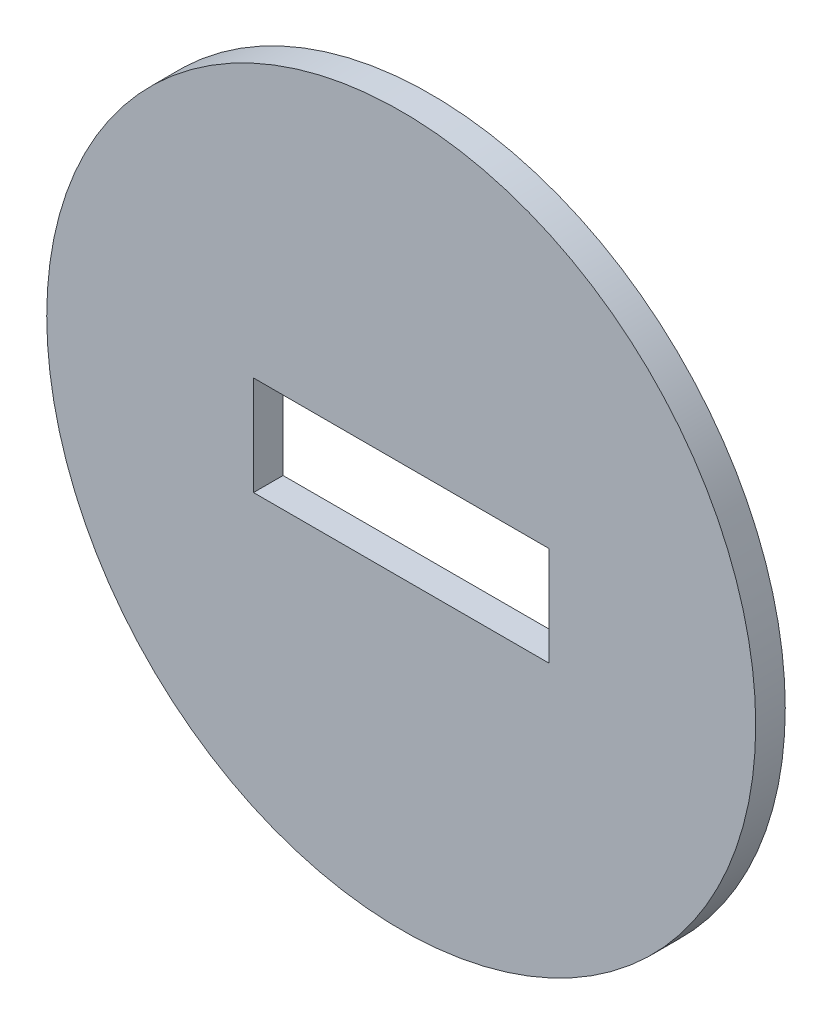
ISO-10303-21;
HEADER;
FILE_DESCRIPTION(('STEP AP214'),'2;1');
FILE_NAME('part.step','',(''),(''),'','','');
FILE_SCHEMA(('AUTOMOTIVE_DESIGN { 1 0 10303 214 1 1 1 1 }'));
ENDSEC;
DATA;
#1=APPLICATION_CONTEXT('core data for automotive mechanical design processes');
#2=APPLICATION_PROTOCOL_DEFINITION('international standard','automotive_design',2000,#1);
#3=PRODUCT_CONTEXT('',#1,'mechanical');
#4=PRODUCT('Part','Part','',(#3));
#5=PRODUCT_RELATED_PRODUCT_CATEGORY('part','',(#4));
#6=PRODUCT_DEFINITION_FORMATION('','',#4);
#7=PRODUCT_DEFINITION_CONTEXT('part definition',#1,'design');
#8=PRODUCT_DEFINITION('design','',#6,#7);
#9=PRODUCT_DEFINITION_SHAPE('','',#8);
#10=(LENGTH_UNIT() NAMED_UNIT(*) SI_UNIT(.MILLI.,.METRE.));
#11=(NAMED_UNIT(*) PLANE_ANGLE_UNIT() SI_UNIT($,.RADIAN.));
#12=(NAMED_UNIT(*) SI_UNIT($,.STERADIAN.) SOLID_ANGLE_UNIT());
#13=UNCERTAINTY_MEASURE_WITH_UNIT(LENGTH_MEASURE(1.E-05),#10,'distance_accuracy_value','');
#14=(GEOMETRIC_REPRESENTATION_CONTEXT(3) GLOBAL_UNCERTAINTY_ASSIGNED_CONTEXT((#13)) GLOBAL_UNIT_ASSIGNED_CONTEXT((#10,
#11,#12)) REPRESENTATION_CONTEXT('',''));
#15=CARTESIAN_POINT('',(0.,0.,0.));
#16=DIRECTION('',(0.,0.,1.));
#17=DIRECTION('',(1.,0.,0.));
#18=AXIS2_PLACEMENT_3D('',#15,#16,#17);
#19=CARTESIAN_POINT('',(0.,0.,3.175));
#20=DIRECTION('',(0.,0.,-1.));
#21=DIRECTION('',(-1.,0.,0.));
#22=AXIS2_PLACEMENT_3D('',#19,#20,#21);
#23=CYLINDRICAL_SURFACE('',#22,38.1);
#24=CARTESIAN_POINT('',(0.,0.,3.175));
#25=DIRECTION('',(0.,0.,1.));
#26=DIRECTION('',(1.,0.,0.));
#27=AXIS2_PLACEMENT_3D('',#24,#25,#26);
#28=CIRCLE('',#27,38.1);
#29=CARTESIAN_POINT('',(38.1,0.,3.175));
#30=VERTEX_POINT('',#29);
#31=EDGE_CURVE('E11',#30,#30,#28,.T.);
#32=ORIENTED_EDGE('',*,*,#31,.F.);
#33=EDGE_LOOP('',(#32));
#34=FACE_BOUND('',#33,.T.);
#35=CARTESIAN_POINT('',(0.,0.,0.));
#36=DIRECTION('',(0.,0.,1.));
#37=DIRECTION('',(1.,0.,0.));
#38=AXIS2_PLACEMENT_3D('',#35,#36,#37);
#39=CIRCLE('',#38,38.1);
#40=CARTESIAN_POINT('',(38.1,0.,0.));
#41=VERTEX_POINT('',#40);
#42=EDGE_CURVE('E38',#41,#41,#39,.T.);
#43=ORIENTED_EDGE('',*,*,#42,.T.);
#44=EDGE_LOOP('',(#43));
#45=FACE_BOUND('',#44,.T.);
#46=ADVANCED_FACE('F31',(#34,#45),#23,.T.);
#47=CARTESIAN_POINT('',(0.,0.,3.175));
#48=DIRECTION('',(0.,0.,1.));
#49=DIRECTION('',(1.,0.,0.));
#50=AXIS2_PLACEMENT_3D('',#47,#48,#49);
#51=PLANE('',#50);
#52=DIRECTION('',(0.,-1.,0.));
#53=VECTOR('',#52,1.);
#54=CARTESIAN_POINT('',(-15.875,5.334,3.175));
#55=LINE('',#54,#53);
#56=CARTESIAN_POINT('',(-15.875,5.334,3.175));
#57=VERTEX_POINT('',#56);
#58=CARTESIAN_POINT('',(-15.875,-5.334,3.175));
#59=VERTEX_POINT('',#58);
#60=EDGE_CURVE('E45',#57,#59,#55,.T.);
#61=ORIENTED_EDGE('',*,*,#60,.F.);
#62=DIRECTION('',(-1.,0.,0.));
#63=VECTOR('',#62,1.);
#64=CARTESIAN_POINT('',(-15.875,5.334,3.175));
#65=LINE('',#64,#63);
#66=CARTESIAN_POINT('',(15.875,5.334,3.175));
#67=VERTEX_POINT('',#66);
#68=EDGE_CURVE('E89',#67,#57,#65,.T.);
#69=ORIENTED_EDGE('',*,*,#68,.F.);
#70=DIRECTION('',(0.,1.,0.));
#71=VECTOR('',#70,1.);
#72=CARTESIAN_POINT('',(15.875,5.334,3.175));
#73=LINE('',#72,#71);
#74=CARTESIAN_POINT('',(15.875,-5.334,3.175));
#75=VERTEX_POINT('',#74);
#76=EDGE_CURVE('E73',#75,#67,#73,.T.);
#77=ORIENTED_EDGE('',*,*,#76,.F.);
#78=DIRECTION('',(1.,0.,0.));
#79=VECTOR('',#78,1.);
#80=CARTESIAN_POINT('',(-15.875,-5.334,3.175));
#81=LINE('',#80,#79);
#82=EDGE_CURVE('E82',#59,#75,#81,.T.);
#83=ORIENTED_EDGE('',*,*,#82,.F.);
#84=EDGE_LOOP('',(#61,#69,#77,#83));
#85=FACE_BOUND('',#84,.T.);
#86=ORIENTED_EDGE('',*,*,#31,.T.);
#87=EDGE_LOOP('',(#86));
#88=FACE_BOUND('',#87,.T.);
#89=ADVANCED_FACE('F86',(#85,#88),#51,.T.);
#90=CARTESIAN_POINT('',(0.,0.,0.));
#91=DIRECTION('',(0.,0.,1.));
#92=DIRECTION('',(1.,0.,0.));
#93=AXIS2_PLACEMENT_3D('',#90,#91,#92);
#94=PLANE('',#93);
#95=DIRECTION('',(-1.,0.,0.));
#96=VECTOR('',#95,1.);
#97=CARTESIAN_POINT('',(-15.875,5.334,0.));
#98=LINE('',#97,#96);
#99=CARTESIAN_POINT('',(15.875,5.334,0.));
#100=VERTEX_POINT('',#99);
#101=CARTESIAN_POINT('',(-15.875,5.334,0.));
#102=VERTEX_POINT('',#101);
#103=EDGE_CURVE('E100',#100,#102,#98,.T.);
#104=ORIENTED_EDGE('',*,*,#103,.T.);
#105=DIRECTION('',(0.,-1.,0.));
#106=VECTOR('',#105,1.);
#107=CARTESIAN_POINT('',(-15.875,5.334,0.));
#108=LINE('',#107,#106);
#109=CARTESIAN_POINT('',(-15.875,-5.334,0.));
#110=VERTEX_POINT('',#109);
#111=EDGE_CURVE('E91',#102,#110,#108,.T.);
#112=ORIENTED_EDGE('',*,*,#111,.T.);
#113=DIRECTION('',(1.,0.,0.));
#114=VECTOR('',#113,1.);
#115=CARTESIAN_POINT('',(-15.875,-5.334,0.));
#116=LINE('',#115,#114);
#117=CARTESIAN_POINT('',(15.875,-5.334,0.));
#118=VERTEX_POINT('',#117);
#119=EDGE_CURVE('E97',#110,#118,#116,.T.);
#120=ORIENTED_EDGE('',*,*,#119,.T.);
#121=DIRECTION('',(0.,1.,0.));
#122=VECTOR('',#121,1.);
#123=CARTESIAN_POINT('',(15.875,5.334,0.));
#124=LINE('',#123,#122);
#125=EDGE_CURVE('E53',#118,#100,#124,.T.);
#126=ORIENTED_EDGE('',*,*,#125,.T.);
#127=EDGE_LOOP('',(#104,#112,#120,#126));
#128=FACE_BOUND('',#127,.T.);
#129=ORIENTED_EDGE('',*,*,#42,.F.);
#130=EDGE_LOOP('',(#129));
#131=FACE_BOUND('',#130,.T.);
#132=ADVANCED_FACE('F110',(#128,#131),#94,.F.);
#133=CARTESIAN_POINT('',(-15.875,5.334,0.));
#134=DIRECTION('',(-1.,0.,0.));
#135=DIRECTION('',(0.,0.,1.));
#136=AXIS2_PLACEMENT_3D('',#133,#134,#135);
#137=PLANE('',#136);
#138=ORIENTED_EDGE('',*,*,#60,.T.);
#139=DIRECTION('',(0.,0.,1.));
#140=VECTOR('',#139,1.);
#141=CARTESIAN_POINT('',(-15.875,-5.334,0.));
#142=LINE('',#141,#140);
#143=EDGE_CURVE('E79',#110,#59,#142,.T.);
#144=ORIENTED_EDGE('',*,*,#143,.F.);
#145=ORIENTED_EDGE('',*,*,#111,.F.);
#146=DIRECTION('',(0.,0.,1.));
#147=VECTOR('',#146,1.);
#148=CARTESIAN_POINT('',(-15.875,5.334,0.));
#149=LINE('',#148,#147);
#150=EDGE_CURVE('E103',#102,#57,#149,.T.);
#151=ORIENTED_EDGE('',*,*,#150,.T.);
#152=EDGE_LOOP('',(#138,#144,#145,#151));
#153=FACE_BOUND('',#152,.T.);
#154=ADVANCED_FACE('F112',(#153),#137,.F.);
#155=CARTESIAN_POINT('',(-15.875,5.334,0.));
#156=DIRECTION('',(0.,1.,0.));
#157=DIRECTION('',(-1.,0.,0.));
#158=AXIS2_PLACEMENT_3D('',#155,#156,#157);
#159=PLANE('',#158);
#160=ORIENTED_EDGE('',*,*,#68,.T.);
#161=ORIENTED_EDGE('',*,*,#150,.F.);
#162=ORIENTED_EDGE('',*,*,#103,.F.);
#163=DIRECTION('',(0.,0.,1.));
#164=VECTOR('',#163,1.);
#165=CARTESIAN_POINT('',(15.875,5.334,0.));
#166=LINE('',#165,#164);
#167=EDGE_CURVE('E78',#100,#67,#166,.T.);
#168=ORIENTED_EDGE('',*,*,#167,.T.);
#169=EDGE_LOOP('',(#160,#161,#162,#168));
#170=FACE_BOUND('',#169,.T.);
#171=ADVANCED_FACE('F119',(#170),#159,.F.);
#172=CARTESIAN_POINT('',(15.875,5.334,0.));
#173=DIRECTION('',(1.,0.,0.));
#174=DIRECTION('',(0.,0.,-1.));
#175=AXIS2_PLACEMENT_3D('',#172,#173,#174);
#176=PLANE('',#175);
#177=ORIENTED_EDGE('',*,*,#76,.T.);
#178=ORIENTED_EDGE('',*,*,#167,.F.);
#179=ORIENTED_EDGE('',*,*,#125,.F.);
#180=DIRECTION('',(0.,0.,1.));
#181=VECTOR('',#180,1.);
#182=CARTESIAN_POINT('',(15.875,-5.334,0.));
#183=LINE('',#182,#181);
#184=EDGE_CURVE('E69',#118,#75,#183,.T.);
#185=ORIENTED_EDGE('',*,*,#184,.T.);
#186=EDGE_LOOP('',(#177,#178,#179,#185));
#187=FACE_BOUND('',#186,.T.);
#188=ADVANCED_FACE('F71',(#187),#176,.F.);
#189=CARTESIAN_POINT('',(-15.875,-5.334,0.));
#190=DIRECTION('',(0.,-1.,0.));
#191=DIRECTION('',(1.,0.,0.));
#192=AXIS2_PLACEMENT_3D('',#189,#190,#191);
#193=PLANE('',#192);
#194=ORIENTED_EDGE('',*,*,#82,.T.);
#195=ORIENTED_EDGE('',*,*,#184,.F.);
#196=ORIENTED_EDGE('',*,*,#119,.F.);
#197=ORIENTED_EDGE('',*,*,#143,.T.);
#198=EDGE_LOOP('',(#194,#195,#196,#197));
#199=FACE_BOUND('',#198,.T.);
#200=ADVANCED_FACE('F83',(#199),#193,.F.);
#201=CLOSED_SHELL('',(#46,#89,#132,#154,#171,#188,#200));
#202=MANIFOLD_SOLID_BREP('B2',#201);
#203=ADVANCED_BREP_SHAPE_REPRESENTATION('',(#18,#202),#14);
#204=SHAPE_DEFINITION_REPRESENTATION(#9,#203);
ENDSEC;
END-ISO-10303-21;
